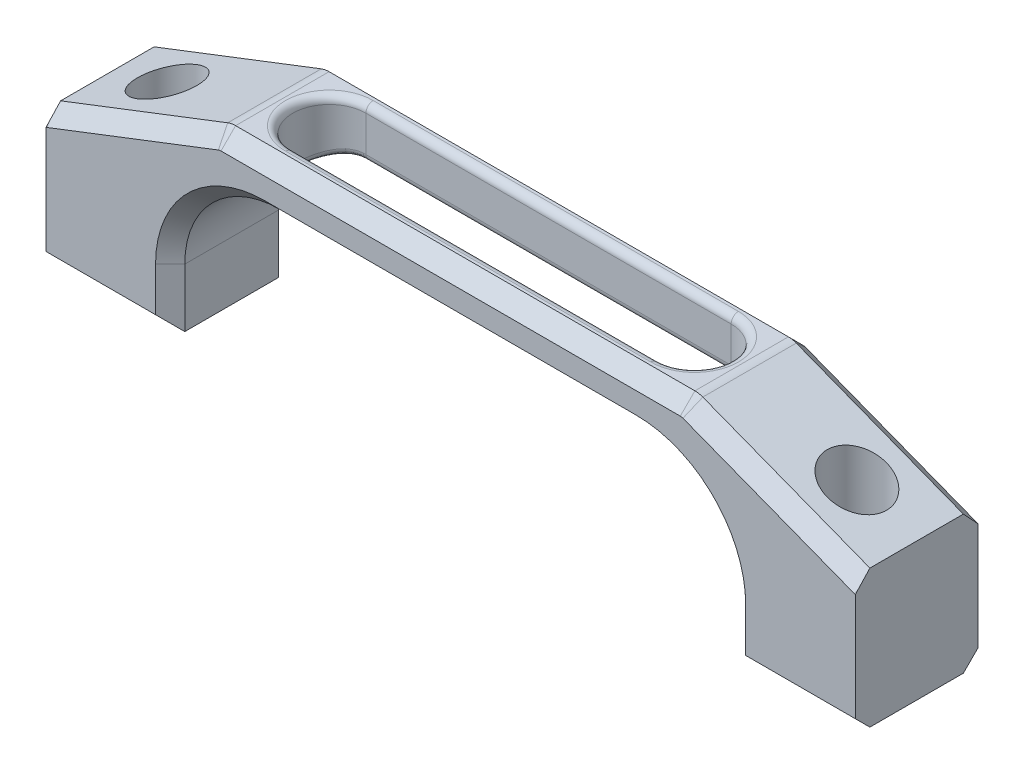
from build123d import *

# Parameters (mm, degrees)
EXTRUDE1_DEPTH                                   = 10.668
CHAMFER1_SIZE                                    = 2.54
CHAMFER2_SIZE                                    = 2.54
CBORE_FOR_1_4_SOCKET_SHOULDER_SCREW1_D           = 6.7564
CBORE_FOR_1_4_SOCKET_SHOULDER_SCREW1_CBORE_D     = 10.31748
CBORE_FOR_1_4_SOCKET_SHOULDER_SCREW1_CBORE_DEPTH = 12.7
CUT_EXTRUDE1_DEPTH                               = 83.318271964
FILLET2_R                                        = 1.27
SKETCH8_W                                        = 24.912554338
SKETCH8_H                                        = 30.165514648
CUT_EXTRUDE2_DEPTH                               = 3.175


with BuildPart() as part:
    # Sketch1 → Extrude1 (new, symmetric)
    with BuildSketch(Plane.XY):
        with BuildLine():
            Line((-73.533, -35.431477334), (-48.768, -35.431477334))
            Line((-48.768, -35.431477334), (-48.768, -25.271477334))
            ThreePointArc((-48.768, -25.271477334), (-43.932332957, -13.597144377), (-32.258, -8.761477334))
            Line((-32.258, -8.761477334), (32.258, -8.761477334))
            ThreePointArc((32.258, -8.761477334), (43.932332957, -13.597144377), (48.768, -25.271477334))
            Line((48.768, -25.271477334), (48.768, -35.431477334))
            Line((48.768, -35.431477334), (73.533, -35.431477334))
            Line((73.533, -35.431477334), (73.533, -15.311671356))
            ThreePointArc((73.533, -15.311671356), (72.864977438, -13.15665911), (71.095163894, -11.757340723))
            Line((71.095163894, -11.757340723), (41.302263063, -0.255669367))
            ThreePointArc((41.302263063, -0.255669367), (40.627988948, -0.064462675), (39.930099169, 0))
            Line((39.930099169, 0), (-39.930099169, 0))
            ThreePointArc((-39.930099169, 0), (-40.627988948, -0.064462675), (-41.302263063, -0.255669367))
            Line((-41.302263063, -0.255669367), (-71.095163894, -11.757340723))
            ThreePointArc((-71.095163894, -11.757340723), (-72.864977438, -13.15665911), (-73.533, -15.311671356))
            Line((-73.533, -15.311671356), (-73.533, -35.431477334))
        make_face()
    extrude(amount=EXTRUDE1_DEPTH, both=True)

    # Chamfer1
    chamfer1_edges = [part.edges().sort_by_distance(p)[0] for p in [
        (-48.768, -30.351477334, 10.668),
        (-43.932332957, -13.597144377, 10.668),
        (0, -8.761477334, 10.668),
        (43.932332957, -13.597144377, 10.668),
        (48.768, -30.351477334, 10.668),
        (61.1505, -35.431477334, 10.668),
        (73.533, -25.371574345, 10.668),
        (72.864977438, -13.15665911, 10.668),
        (56.198713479, -6.006505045, 10.668),
        (40.627988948, -0.064462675, 10.668),
        (-73.533, -25.371574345, 10.668),
        (0, 0, 10.668),
        (-40.627988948, -0.064462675, 10.668),
        (-56.198713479, -6.006505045, 10.668),
        (-72.864977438, -13.15665911, 10.668),
        (-61.1505, -35.431477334, 10.668),
    ]]
    chamfer(chamfer1_edges, length=CHAMFER1_SIZE)

    # Chamfer2
    chamfer2_edges = [part.edges().sort_by_distance(p)[0] for p in [
        (-72.864977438, -13.15665911, -10.668),
        (-56.198713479, -6.006505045, -10.668),
        (-40.627988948, -0.064462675, -10.668),
        (0, 0, -10.668),
        (40.627988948, -0.064462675, -10.668),
        (56.198713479, -6.006505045, -10.668),
        (72.864977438, -13.15665911, -10.668),
        (73.533, -25.371574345, -10.668),
        (61.1505, -35.431477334, -10.668),
        (48.768, -30.351477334, -10.668),
        (43.932332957, -13.597144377, -10.668),
        (0, -8.761477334, -10.668),
        (-43.932332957, -13.597144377, -10.668),
        (-48.768, -30.351477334, -10.668),
        (-61.1505, -35.431477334, -10.668),
        (-73.533, -25.371574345, -10.668),
    ]]
    chamfer(chamfer2_edges, length=CHAMFER2_SIZE)

    # CBORE for 1_4 Socket Shoulder Screw1 (through all)
    with Locations(Plane(origin=(0, -4.951477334, 0), x_dir=(1, 0, 0), z_dir=(0, 1, 0))):
        with Locations((-59.9694, 0), (59.9694, 0)):
            CounterBoreHole(CBORE_FOR_1_4_SOCKET_SHOULDER_SCREW1_D / 2, CBORE_FOR_1_4_SOCKET_SHOULDER_SCREW1_CBORE_D / 2, CBORE_FOR_1_4_SOCKET_SHOULDER_SCREW1_CBORE_DEPTH)

    # Sketch7 → Cut-Extrude1 (cut, through all)
    with BuildSketch(Plane(origin=(0, 0, 0), x_dir=(-1, 0, 0), z_dir=(0, 1, 0))):
        with BuildLine():
            Line((-31.75, -6.35), (31.75, -6.35))
            ThreePointArc((31.75, -6.35), (38.1, 0), (31.75, 6.35))
            Line((31.75, 6.35), (-31.75, 6.35))
            ThreePointArc((-31.75, 6.35), (-38.1, 0), (-31.75, -6.35))
        make_face()
    extrude(amount=-CUT_EXTRUDE1_DEPTH, mode=Mode.SUBTRACT)

    # Fillet2
    fillet2_edges = [part.edges().sort_by_distance(p)[0] for p in [
        (32.004203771, -8.761477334, 6.344909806),
        (38.1, -9.829614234, 0),
        (32.004203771, -8.761477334, -6.344909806),
        (0, -8.761477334, 6.35),
        (-32.004203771, -8.761477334, -6.344909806),
        (-38.1, -9.829614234, 0),
        (-32.004203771, -8.761477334, 6.344909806),
        (0, -8.761477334, -6.35),
        (38.1, 0, 0),
        (0, 0, -6.35),
        (-38.1, 0, 0),
        (0, 0, 6.35),
    ]]
    fillet(fillet2_edges, radius=FILLET2_R)

    # Sketch8 → Cut-Extrude2 (cut)
    with BuildSketch(Plane.ZY.offset(73.533)):
        with Locations((0.026004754, -25.517164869)):
            Rectangle(SKETCH8_W, SKETCH8_H)
    cut_extrude2 = extrude(amount=-CUT_EXTRUDE2_DEPTH, mode=Mode.SUBTRACT)

    # Mirror1: Cut-Extrude2 across plane
    add(cut_extrude2.mirror(Plane(origin=(0, 0, 0), x_dir=(0, 0, 1), z_dir=(1, 0, 0))), mode=Mode.SUBTRACT)


solid = part.part
